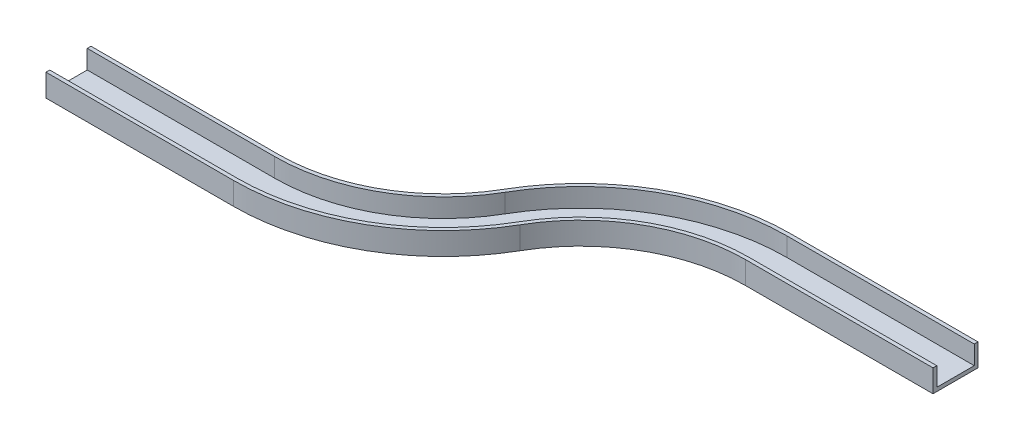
from build123d import *


with BuildPart() as part:
    # Austragung1: sweep along a path in Skizze1
    with BuildLine(Plane(origin=(0, 0, 0), x_dir=(1, 0, 0), z_dir=(0, 1, 0))) as austragung1_path:
        Line((-500, 0), (0, 0))
        ThreePointArc((0, 0), (250, 66.987298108), (433.012701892, 250))
        ThreePointArc((433.012701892, 250), (616.025403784, 433.012701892), (866.025403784, 500))
        Line((866.025403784, 500), (1366.025403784, 500))
    # Skizze2 → Austragung1 (sweep)
    with BuildSketch(Plane(origin=(1366.025403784, 0, -500), x_dir=(0, 0, -1), z_dir=(1, 0, 0))):
        Polygon((-60, 50), (-60, -10), (60, -10), (60, 50), (50, 50), (50, 0), (-50, 0), (-50, 50), align=None)
    sweep(path=austragung1_path.line)


solid = part.part
